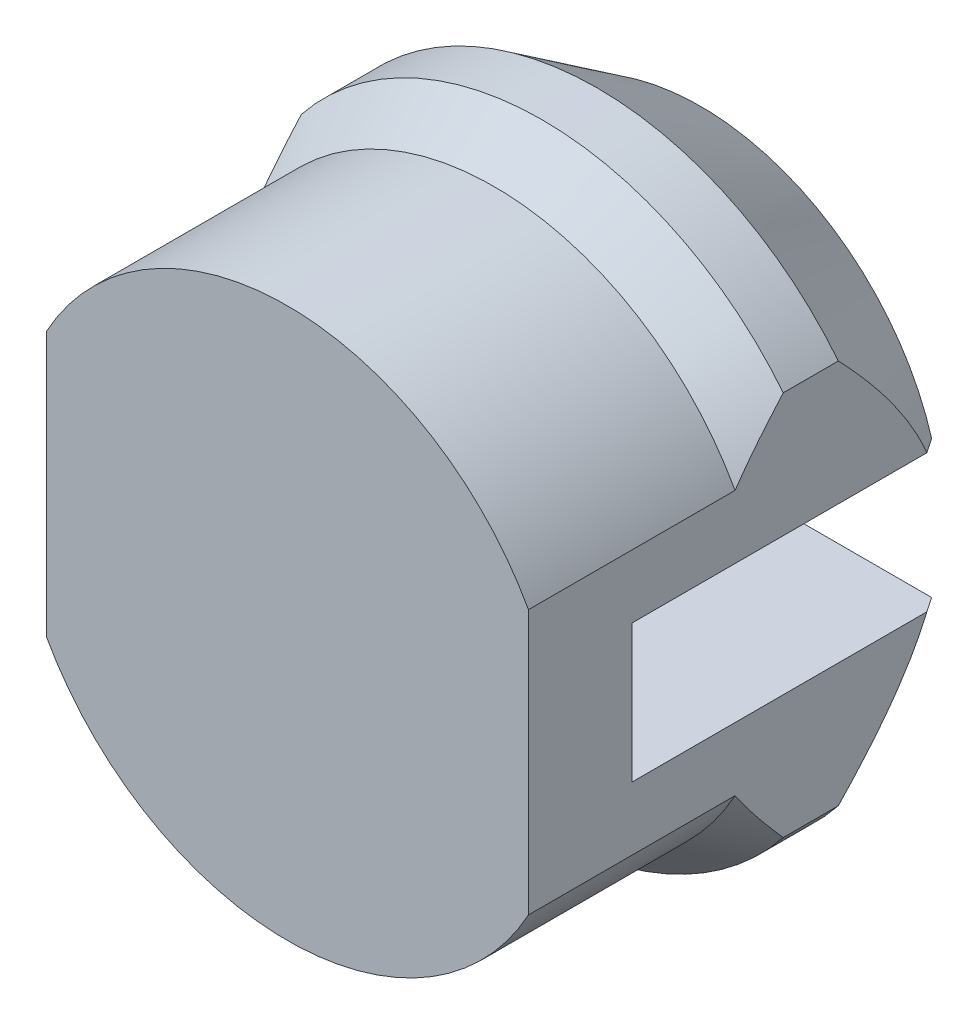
from build123d import *

# Parameters (mm, degrees)
SKETCH9_W          = 8.960103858
SKETCH9_H          = 2
CUT_EXTRUDE2_DEPTH = 4.5
SKETCH10_W         = 0.980051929
SKETCH10_H         = 5.593162
CUT_EXTRUDE4_DEPTH = 9.668432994


with BuildPart() as part:
    # Sketch7 → Revolve2 (revolve)
    with BuildSketch(Plane(origin=(0, 0, 0), x_dir=(1, 0, 0), z_dir=(0, 1, 0)), mode=Mode.PRIVATE) as revolve2_sk:
        Polygon((3.499999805, 6), (1.589004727, 6), (1.589004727, 1.5), (0, 1.5), (0, 0), (3.991740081, 0), (3.991740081, 3), (4.480051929, 3.7), (4.480051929, 4.5), align=None)
    revolve(revolve2_sk.sketch.rotate(Axis((0, 0, -1.5), (0, 0, 1)), 180), axis=Axis((0, 0, -1.5), (0, 0, 1)))

    # Sketch9 → Cut-Extrude2 (cut)
    with BuildSketch(Plane(origin=(0, 0, -6), x_dir=(-1, 0, 0), z_dir=(0, 0, -1))):
        Rectangle(SKETCH9_W, SKETCH9_H)
    extrude(amount=-CUT_EXTRUDE2_DEPTH, mode=Mode.SUBTRACT)

    # Sketch10 → Cut-Extrude4 (cut, through all)
    with BuildSketch(Plane(origin=(0, 0, -6), x_dir=(-1, 0, 0), z_dir=(0, 0, -1))):
        with Locations((-3.990025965, 0)):
            Rectangle(SKETCH10_W, SKETCH10_H)
        with Locations((3.990025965, 0)):
            Rectangle(SKETCH10_W, SKETCH10_H)
    extrude(amount=-CUT_EXTRUDE4_DEPTH, mode=Mode.SUBTRACT)


solid = part.part
